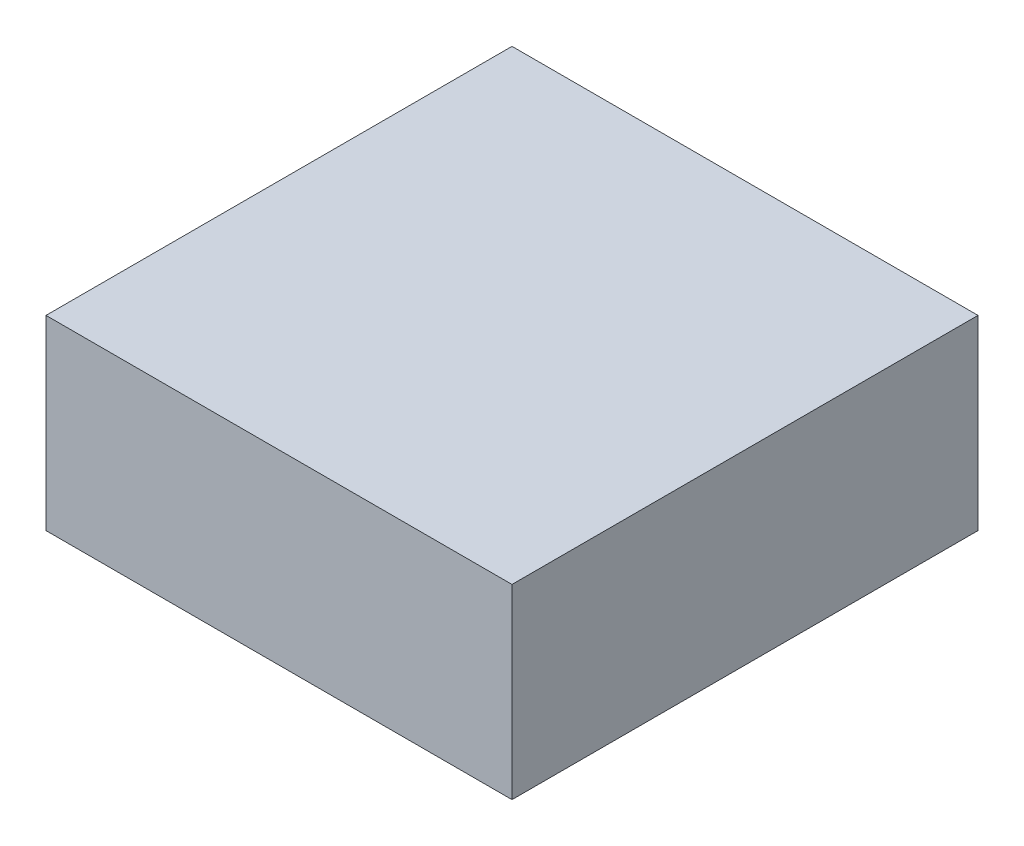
from build123d import *

# Parameters (mm, degrees)
SKETCH1_W           = 150
SKETCH1_H           = 150
BOSS_EXTRUDE1_DEPTH = 60


with BuildPart() as part:
    # Sketch1 → Boss-Extrude1 (new body)
    with BuildSketch(Plane(origin=(0, 0, 0), x_dir=(1, 0, 0), z_dir=(0, 1, 0))):
        Rectangle(SKETCH1_W, SKETCH1_H)
    extrude(amount=BOSS_EXTRUDE1_DEPTH)


solid = part.part
